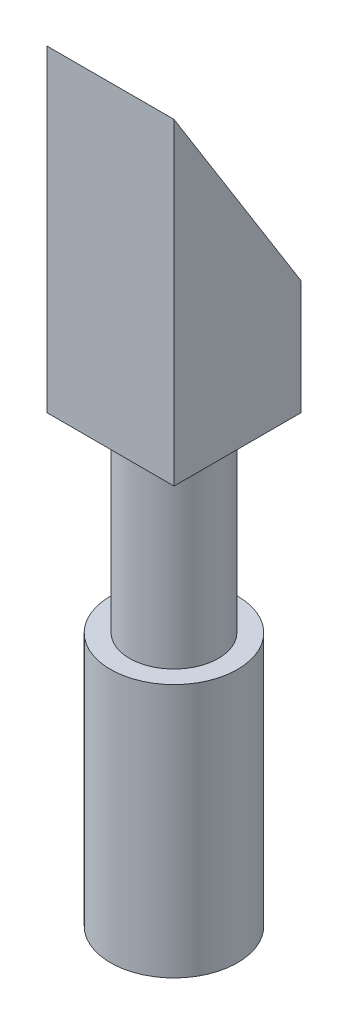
ISO-10303-21;
HEADER;
FILE_DESCRIPTION(('STEP AP214'),'2;1');
FILE_NAME('part.step','',(''),(''),'','','');
FILE_SCHEMA(('AUTOMOTIVE_DESIGN { 1 0 10303 214 1 1 1 1 }'));
ENDSEC;
DATA;
#1=APPLICATION_CONTEXT('core data for automotive mechanical design processes');
#2=APPLICATION_PROTOCOL_DEFINITION('international standard','automotive_design',2000,#1);
#3=PRODUCT_CONTEXT('',#1,'mechanical');
#4=PRODUCT('Part','Part','',(#3));
#5=PRODUCT_RELATED_PRODUCT_CATEGORY('part','',(#4));
#6=PRODUCT_DEFINITION_FORMATION('','',#4);
#7=PRODUCT_DEFINITION_CONTEXT('part definition',#1,'design');
#8=PRODUCT_DEFINITION('design','',#6,#7);
#9=PRODUCT_DEFINITION_SHAPE('','',#8);
#10=(LENGTH_UNIT() NAMED_UNIT(*) SI_UNIT(.MILLI.,.METRE.));
#11=(NAMED_UNIT(*) PLANE_ANGLE_UNIT() SI_UNIT($,.RADIAN.));
#12=(NAMED_UNIT(*) SI_UNIT($,.STERADIAN.) SOLID_ANGLE_UNIT());
#13=UNCERTAINTY_MEASURE_WITH_UNIT(LENGTH_MEASURE(1.E-05),#10,'distance_accuracy_value','');
#14=(GEOMETRIC_REPRESENTATION_CONTEXT(3) GLOBAL_UNCERTAINTY_ASSIGNED_CONTEXT((#13)) GLOBAL_UNIT_ASSIGNED_CONTEXT((#10,
#11,#12)) REPRESENTATION_CONTEXT('',''));
#15=CARTESIAN_POINT('',(0.,0.,0.));
#16=DIRECTION('',(0.,0.,1.));
#17=DIRECTION('',(1.,0.,0.));
#18=AXIS2_PLACEMENT_3D('',#15,#16,#17);
#19=CARTESIAN_POINT('',(7.19396066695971,0.,6.35466525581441));
#20=DIRECTION('',(0.,1.,0.));
#21=DIRECTION('',(0.,0.,1.));
#22=AXIS2_PLACEMENT_3D('',#19,#20,#21);
#23=PLANE('',#22);
#24=DIRECTION('',(0.,0.,-1.));
#25=VECTOR('',#24,1.);
#26=CARTESIAN_POINT('',(7.19396066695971,0.,-6.3453347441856));
#27=LINE('',#26,#25);
#28=CARTESIAN_POINT('',(7.19396066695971,0.,6.35466525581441));
#29=VERTEX_POINT('',#28);
#30=CARTESIAN_POINT('',(7.19396066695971,0.,-6.3453347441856));
#31=VERTEX_POINT('',#30);
#32=EDGE_CURVE('E88',#29,#31,#27,.T.);
#33=ORIENTED_EDGE('',*,*,#32,.F.);
#34=DIRECTION('',(1.,0.,0.));
#35=VECTOR('',#34,1.);
#36=CARTESIAN_POINT('',(-5.50603933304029,0.,6.35466525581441));
#37=LINE('',#36,#35);
#38=CARTESIAN_POINT('',(-5.50603933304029,0.,6.35466525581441));
#39=VERTEX_POINT('',#38);
#40=EDGE_CURVE('E79',#39,#29,#37,.T.);
#41=ORIENTED_EDGE('',*,*,#40,.F.);
#42=DIRECTION('',(0.,0.,1.));
#43=VECTOR('',#42,1.);
#44=CARTESIAN_POINT('',(-5.50603933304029,0.,-6.3453347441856));
#45=LINE('',#44,#43);
#46=CARTESIAN_POINT('',(-5.50603933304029,0.,-6.3453347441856));
#47=VERTEX_POINT('',#46);
#48=EDGE_CURVE('E92',#47,#39,#45,.T.);
#49=ORIENTED_EDGE('',*,*,#48,.F.);
#50=DIRECTION('',(-1.,0.,0.));
#51=VECTOR('',#50,1.);
#52=CARTESIAN_POINT('',(-5.50603933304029,0.,-6.3453347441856));
#53=LINE('',#52,#51);
#54=EDGE_CURVE('E97',#31,#47,#53,.T.);
#55=ORIENTED_EDGE('',*,*,#54,.F.);
#56=EDGE_LOOP('',(#33,#41,#49,#55));
#57=FACE_BOUND('',#56,.T.);
#58=CARTESIAN_POINT('',(0.843960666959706,0.,0.0046652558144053));
#59=DIRECTION('',(0.,1.,0.));
#60=DIRECTION('',(0.,0.,1.));
#61=AXIS2_PLACEMENT_3D('',#58,#59,#60);
#62=CIRCLE('',#61,4.445);
#63=CARTESIAN_POINT('',(0.843960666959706,0.,4.4496652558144));
#64=VERTEX_POINT('',#63);
#65=EDGE_CURVE('E11',#64,#64,#62,.F.);
#66=ORIENTED_EDGE('',*,*,#65,.F.);
#67=EDGE_LOOP('',(#66));
#68=FACE_BOUND('',#67,.T.);
#69=ADVANCED_FACE('F31',(#57,#68),#23,.F.);
#70=CARTESIAN_POINT('',(7.19396066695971,31.75,-6.3453347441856));
#71=DIRECTION('',(-1.,0.,0.));
#72=DIRECTION('',(0.,0.,1.));
#73=AXIS2_PLACEMENT_3D('',#70,#71,#72);
#74=PLANE('',#73);
#75=DIRECTION('',(0.,-0.847998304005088,-0.52999894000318));
#76=VECTOR('',#75,1.);
#77=CARTESIAN_POINT('',(7.19396066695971,26.0421348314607,2.78724952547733));
#78=LINE('',#77,#76);
#79=CARTESIAN_POINT('',(7.19396066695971,31.75,6.35466525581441));
#80=VERTEX_POINT('',#79);
#81=CARTESIAN_POINT('',(7.19396066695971,11.43,-6.3453347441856));
#82=VERTEX_POINT('',#81);
#83=EDGE_CURVE('E86',#80,#82,#78,.T.);
#84=ORIENTED_EDGE('',*,*,#83,.F.);
#85=DIRECTION('',(0.,-1.,0.));
#86=VECTOR('',#85,1.);
#87=CARTESIAN_POINT('',(7.19396066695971,31.75,6.35466525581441));
#88=LINE('',#87,#86);
#89=EDGE_CURVE('E72',#80,#29,#88,.T.);
#90=ORIENTED_EDGE('',*,*,#89,.T.);
#91=ORIENTED_EDGE('',*,*,#32,.T.);
#92=DIRECTION('',(0.,-1.,0.));
#93=VECTOR('',#92,1.);
#94=CARTESIAN_POINT('',(7.19396066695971,31.75,-6.3453347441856));
#95=LINE('',#94,#93);
#96=EDGE_CURVE('E39',#82,#31,#95,.T.);
#97=ORIENTED_EDGE('',*,*,#96,.F.);
#98=EDGE_LOOP('',(#84,#90,#91,#97));
#99=FACE_BOUND('',#98,.T.);
#100=ADVANCED_FACE('F33',(#99),#74,.F.);
#101=CARTESIAN_POINT('',(-5.50603933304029,31.75,-6.3453347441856));
#102=DIRECTION('',(0.,0.,1.));
#103=DIRECTION('',(1.,0.,0.));
#104=AXIS2_PLACEMENT_3D('',#101,#102,#103);
#105=PLANE('',#104);
#106=DIRECTION('',(-1.,0.,0.));
#107=VECTOR('',#106,1.);
#108=CARTESIAN_POINT('',(52.7914266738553,11.43,-6.34533474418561));
#109=LINE('',#108,#107);
#110=CARTESIAN_POINT('',(-5.50603933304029,11.43,-6.3453347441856));
#111=VERTEX_POINT('',#110);
#112=EDGE_CURVE('E46',#82,#111,#109,.T.);
#113=ORIENTED_EDGE('',*,*,#112,.F.);
#114=ORIENTED_EDGE('',*,*,#96,.T.);
#115=ORIENTED_EDGE('',*,*,#54,.T.);
#116=DIRECTION('',(0.,-1.,0.));
#117=VECTOR('',#116,1.);
#118=CARTESIAN_POINT('',(-5.50603933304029,31.75,-6.3453347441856));
#119=LINE('',#118,#117);
#120=EDGE_CURVE('E102',#111,#47,#119,.T.);
#121=ORIENTED_EDGE('',*,*,#120,.F.);
#122=EDGE_LOOP('',(#113,#114,#115,#121));
#123=FACE_BOUND('',#122,.T.);
#124=ADVANCED_FACE('F104',(#123),#105,.F.);
#125=CARTESIAN_POINT('',(-5.50603933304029,31.75,-6.3453347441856));
#126=DIRECTION('',(1.,0.,0.));
#127=DIRECTION('',(0.,0.,-1.));
#128=AXIS2_PLACEMENT_3D('',#125,#126,#127);
#129=PLANE('',#128);
#130=DIRECTION('',(0.,0.847998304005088,0.52999894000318));
#131=VECTOR('',#130,1.);
#132=CARTESIAN_POINT('',(-5.50603933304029,26.0421348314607,2.78724952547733));
#133=LINE('',#132,#131);
#134=CARTESIAN_POINT('',(-5.50603933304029,31.75,6.35466525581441));
#135=VERTEX_POINT('',#134);
#136=EDGE_CURVE('E54',#111,#135,#133,.T.);
#137=ORIENTED_EDGE('',*,*,#136,.F.);
#138=ORIENTED_EDGE('',*,*,#120,.T.);
#139=ORIENTED_EDGE('',*,*,#48,.T.);
#140=DIRECTION('',(0.,-1.,0.));
#141=VECTOR('',#140,1.);
#142=CARTESIAN_POINT('',(-5.50603933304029,31.75,6.35466525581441));
#143=LINE('',#142,#141);
#144=EDGE_CURVE('E83',#135,#39,#143,.T.);
#145=ORIENTED_EDGE('',*,*,#144,.F.);
#146=EDGE_LOOP('',(#137,#138,#139,#145));
#147=FACE_BOUND('',#146,.T.);
#148=ADVANCED_FACE('F108',(#147),#129,.F.);
#149=CARTESIAN_POINT('',(-5.50603933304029,31.75,6.35466525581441));
#150=DIRECTION('',(0.,0.,-1.));
#151=DIRECTION('',(-1.,0.,0.));
#152=AXIS2_PLACEMENT_3D('',#149,#150,#151);
#153=PLANE('',#152);
#154=ORIENTED_EDGE('',*,*,#40,.T.);
#155=ORIENTED_EDGE('',*,*,#89,.F.);
#156=DIRECTION('',(1.,0.,0.));
#157=VECTOR('',#156,1.);
#158=CARTESIAN_POINT('',(-5.50603933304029,31.75,6.35466525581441));
#159=LINE('',#158,#157);
#160=EDGE_CURVE('E77',#135,#80,#159,.T.);
#161=ORIENTED_EDGE('',*,*,#160,.F.);
#162=ORIENTED_EDGE('',*,*,#144,.T.);
#163=EDGE_LOOP('',(#154,#155,#161,#162));
#164=FACE_BOUND('',#163,.T.);
#165=ADVANCED_FACE('F74',(#164),#153,.F.);
#166=CARTESIAN_POINT('',(52.7914266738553,31.75,6.3546652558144));
#167=DIRECTION('',(0.,0.52999894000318,-0.847998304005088));
#168=DIRECTION('',(0.,0.847998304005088,0.52999894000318));
#169=AXIS2_PLACEMENT_3D('',#166,#167,#168);
#170=PLANE('',#169);
#171=ORIENTED_EDGE('',*,*,#160,.T.);
#172=ORIENTED_EDGE('',*,*,#83,.T.);
#173=ORIENTED_EDGE('',*,*,#112,.T.);
#174=ORIENTED_EDGE('',*,*,#136,.T.);
#175=EDGE_LOOP('',(#171,#172,#173,#174));
#176=FACE_BOUND('',#175,.T.);
#177=ADVANCED_FACE('F90',(#176),#170,.T.);
#178=CARTESIAN_POINT('',(0.843960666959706,-19.05,0.0046652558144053));
#179=DIRECTION('',(0.,1.,0.));
#180=DIRECTION('',(0.,0.,1.));
#181=AXIS2_PLACEMENT_3D('',#178,#179,#180);
#182=CYLINDRICAL_SURFACE('',#181,4.445);
#183=CARTESIAN_POINT('',(0.843960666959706,-19.05,0.0046652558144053));
#184=DIRECTION('',(0.,-1.,0.));
#185=DIRECTION('',(0.,0.,-1.));
#186=AXIS2_PLACEMENT_3D('',#183,#184,#185);
#187=CIRCLE('',#186,4.445);
#188=CARTESIAN_POINT('',(0.843960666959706,-19.05,4.4496652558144));
#189=VERTEX_POINT('',#188);
#190=EDGE_CURVE('E109',#189,#189,#187,.T.);
#191=CARTESIAN_POINT('',(0.843960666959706,-19.05,4.4496652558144));
#192=CARTESIAN_POINT('',(0.843960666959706,-18.8515625,4.4496652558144));
#193=CARTESIAN_POINT('',(0.843960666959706,-18.653125,4.4496652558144));
#194=CARTESIAN_POINT('',(0.843960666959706,-18.25625,4.4496652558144));
#195=CARTESIAN_POINT('',(0.843960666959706,-18.0578125,4.4496652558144));
#196=CARTESIAN_POINT('',(0.843960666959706,-17.6609375,4.4496652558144));
#197=CARTESIAN_POINT('',(0.843960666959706,-17.4625,4.4496652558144));
#198=CARTESIAN_POINT('',(0.843960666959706,-17.065625,4.4496652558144));
#199=CARTESIAN_POINT('',(0.843960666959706,-16.8671875,4.4496652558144));
#200=CARTESIAN_POINT('',(0.843960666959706,-16.4703125,4.4496652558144));
#201=CARTESIAN_POINT('',(0.843960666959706,-16.271875,4.4496652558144));
#202=CARTESIAN_POINT('',(0.843960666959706,-15.875,4.4496652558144));
#203=CARTESIAN_POINT('',(0.843960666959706,-15.6765625,4.4496652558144));
#204=CARTESIAN_POINT('',(0.843960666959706,-15.2796875,4.4496652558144));
#205=CARTESIAN_POINT('',(0.843960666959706,-15.08125,4.4496652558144));
#206=CARTESIAN_POINT('',(0.843960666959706,-14.684375,4.4496652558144));
#207=CARTESIAN_POINT('',(0.843960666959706,-14.4859375,4.4496652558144));
#208=CARTESIAN_POINT('',(0.843960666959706,-14.0890625,4.4496652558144));
#209=CARTESIAN_POINT('',(0.843960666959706,-13.890625,4.4496652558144));
#210=CARTESIAN_POINT('',(0.843960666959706,-13.49375,4.4496652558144));
#211=CARTESIAN_POINT('',(0.843960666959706,-13.2953125,4.4496652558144));
#212=CARTESIAN_POINT('',(0.843960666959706,-12.8984375,4.4496652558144));
#213=CARTESIAN_POINT('',(0.843960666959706,-12.7,4.4496652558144));
#214=CARTESIAN_POINT('',(0.843960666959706,-12.303125,4.4496652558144));
#215=CARTESIAN_POINT('',(0.843960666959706,-12.1046875,4.4496652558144));
#216=CARTESIAN_POINT('',(0.843960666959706,-11.7078125,4.4496652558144));
#217=CARTESIAN_POINT('',(0.843960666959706,-11.509375,4.4496652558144));
#218=CARTESIAN_POINT('',(0.843960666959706,-11.1125,4.4496652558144));
#219=CARTESIAN_POINT('',(0.843960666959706,-10.9140625,4.4496652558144));
#220=CARTESIAN_POINT('',(0.843960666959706,-10.5171875,4.4496652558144));
#221=CARTESIAN_POINT('',(0.843960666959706,-10.31875,4.4496652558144));
#222=CARTESIAN_POINT('',(0.843960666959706,-9.921875,4.4496652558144));
#223=CARTESIAN_POINT('',(0.843960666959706,-9.7234375,4.4496652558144));
#224=CARTESIAN_POINT('',(0.843960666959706,-9.3265625,4.4496652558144));
#225=CARTESIAN_POINT('',(0.843960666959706,-9.128125,4.4496652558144));
#226=CARTESIAN_POINT('',(0.843960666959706,-8.73125,4.4496652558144));
#227=CARTESIAN_POINT('',(0.843960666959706,-8.5328125,4.4496652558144));
#228=CARTESIAN_POINT('',(0.843960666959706,-8.1359375,4.4496652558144));
#229=CARTESIAN_POINT('',(0.843960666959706,-7.9375,4.4496652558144));
#230=CARTESIAN_POINT('',(0.843960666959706,-7.540625,4.4496652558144));
#231=CARTESIAN_POINT('',(0.843960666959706,-7.3421875,4.4496652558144));
#232=CARTESIAN_POINT('',(0.843960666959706,-6.9453125,4.4496652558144));
#233=CARTESIAN_POINT('',(0.843960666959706,-6.746875,4.4496652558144));
#234=CARTESIAN_POINT('',(0.843960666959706,-6.35,4.4496652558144));
#235=CARTESIAN_POINT('',(0.843960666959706,-6.1515625,4.4496652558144));
#236=CARTESIAN_POINT('',(0.843960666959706,-5.7546875,4.4496652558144));
#237=CARTESIAN_POINT('',(0.843960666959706,-5.55625,4.4496652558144));
#238=CARTESIAN_POINT('',(0.843960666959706,-5.159375,4.4496652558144));
#239=CARTESIAN_POINT('',(0.843960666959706,-4.9609375,4.4496652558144));
#240=CARTESIAN_POINT('',(0.843960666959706,-4.5640625,4.4496652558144));
#241=CARTESIAN_POINT('',(0.843960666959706,-4.365625,4.4496652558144));
#242=CARTESIAN_POINT('',(0.843960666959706,-3.96875,4.4496652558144));
#243=CARTESIAN_POINT('',(0.843960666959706,-3.7703125,4.4496652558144));
#244=CARTESIAN_POINT('',(0.843960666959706,-3.3734375,4.4496652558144));
#245=CARTESIAN_POINT('',(0.843960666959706,-3.175,4.4496652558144));
#246=CARTESIAN_POINT('',(0.843960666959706,-2.778125,4.4496652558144));
#247=CARTESIAN_POINT('',(0.843960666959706,-2.5796875,4.4496652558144));
#248=CARTESIAN_POINT('',(0.843960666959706,-2.1828125,4.4496652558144));
#249=CARTESIAN_POINT('',(0.843960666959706,-1.984375,4.4496652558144));
#250=CARTESIAN_POINT('',(0.843960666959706,-1.5875,4.4496652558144));
#251=CARTESIAN_POINT('',(0.843960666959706,-1.3890625,4.4496652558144));
#252=CARTESIAN_POINT('',(0.843960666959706,-0.992187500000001,4.4496652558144));
#253=CARTESIAN_POINT('',(0.843960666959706,-0.793750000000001,4.4496652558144));
#254=CARTESIAN_POINT('',(0.843960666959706,-0.396875,4.4496652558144));
#255=CARTESIAN_POINT('',(0.843960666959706,-0.1984375,4.4496652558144));
#256=CARTESIAN_POINT('',(0.843960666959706,0.,4.4496652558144));
#257=B_SPLINE_CURVE_WITH_KNOTS('',3,(#191,#192,#193,#194,#195,#196,#197,#198,#199,#200,#201,
#202,#203,#204,#205,#206,#207,#208,#209,#210,#211,#212,#213,#214,#215,#216,#217,#218,#219,#220,
#221,#222,#223,#224,#225,#226,#227,#228,#229,#230,#231,#232,#233,#234,#235,#236,#237,#238,#239,
#240,#241,#242,#243,#244,#245,#246,#247,#248,#249,#250,#251,#252,#253,#254,#255,#256),
.UNSPECIFIED.,.F.,.F.,(4,2,2,2,2,2,2,2,2,2,2,2,2,2,2,2,2,2,2,2,2,2,2,2,2,2,2,2,2,2,2,2,4),(0.,
0.595312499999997,1.190625,1.7859375,2.38125,2.9765625,3.571875,4.1671875,4.7625,5.3578125,
5.953125,6.5484375,7.14375,7.7390625,8.334375,8.9296875,9.525,10.1203125,10.715625,11.3109375,
11.90625,12.5015625,13.096875,13.6921875,14.2875,14.8828125,15.478125,16.0734375,16.66875,
17.2640625,17.859375,18.4546875,19.05),.UNSPECIFIED.);
#258=EDGE_CURVE('BSEAM132',#189,#64,#257,.T.);
#259=ORIENTED_EDGE('',*,*,#190,.F.);
#260=ORIENTED_EDGE('',*,*,#65,.T.);
#261=ORIENTED_EDGE('',*,*,#258,.T.);
#262=ORIENTED_EDGE('',*,*,#258,.F.);
#263=EDGE_LOOP('',(#259,#261,#260,#262));
#264=FACE_BOUND('',#263,.T.);
#265=ADVANCED_FACE('F132',(#264),#182,.T.);
#266=CARTESIAN_POINT('',(0.843960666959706,-19.05,0.0046652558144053));
#267=DIRECTION('',(0.,-1.,0.));
#268=DIRECTION('',(0.,0.,-1.));
#269=AXIS2_PLACEMENT_3D('',#266,#267,#268);
#270=PLANE('',#269);
#271=CARTESIAN_POINT('',(0.843960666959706,-19.05,0.0046652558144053));
#272=DIRECTION('',(0.,-1.,0.));
#273=DIRECTION('',(0.,0.,-1.));
#274=AXIS2_PLACEMENT_3D('',#271,#272,#273);
#275=CIRCLE('',#274,6.35);
#276=CARTESIAN_POINT('',(0.843960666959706,-19.05,-6.34533474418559));
#277=VERTEX_POINT('',#276);
#278=EDGE_CURVE('E115',#277,#277,#275,.T.);
#279=ORIENTED_EDGE('',*,*,#278,.F.);
#280=EDGE_LOOP('',(#279));
#281=FACE_BOUND('',#280,.T.);
#282=ORIENTED_EDGE('',*,*,#190,.T.);
#283=EDGE_LOOP('',(#282));
#284=FACE_BOUND('',#283,.T.);
#285=ADVANCED_FACE('F126',(#281,#284),#270,.F.);
#286=CARTESIAN_POINT('',(0.843960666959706,-44.45,0.0046652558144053));
#287=DIRECTION('',(0.,1.,0.));
#288=DIRECTION('',(0.,0.,1.));
#289=AXIS2_PLACEMENT_3D('',#286,#287,#288);
#290=CYLINDRICAL_SURFACE('',#289,6.35);
#291=CARTESIAN_POINT('',(0.843960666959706,-44.45,0.0046652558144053));
#292=DIRECTION('',(0.,-1.,0.));
#293=DIRECTION('',(0.,0.,-1.));
#294=AXIS2_PLACEMENT_3D('',#291,#292,#293);
#295=CIRCLE('',#294,6.35);
#296=CARTESIAN_POINT('',(0.843960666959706,-44.45,-6.34533474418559));
#297=VERTEX_POINT('',#296);
#298=EDGE_CURVE('E112',#297,#297,#295,.T.);
#299=ORIENTED_EDGE('',*,*,#298,.F.);
#300=EDGE_LOOP('',(#299));
#301=FACE_BOUND('',#300,.T.);
#302=ORIENTED_EDGE('',*,*,#278,.T.);
#303=EDGE_LOOP('',(#302));
#304=FACE_BOUND('',#303,.T.);
#305=ADVANCED_FACE('F123',(#301,#304),#290,.T.);
#306=CARTESIAN_POINT('',(0.843960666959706,-44.45,0.0046652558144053));
#307=DIRECTION('',(0.,-1.,0.));
#308=DIRECTION('',(0.,0.,-1.));
#309=AXIS2_PLACEMENT_3D('',#306,#307,#308);
#310=PLANE('',#309);
#311=ORIENTED_EDGE('',*,*,#298,.T.);
#312=EDGE_LOOP('',(#311));
#313=FACE_BOUND('',#312,.T.);
#314=ADVANCED_FACE('F121',(#313),#310,.T.);
#315=CLOSED_SHELL('',(#69,#100,#124,#148,#165,#177,#265,#285,#305,#314));
#316=MANIFOLD_SOLID_BREP('B2',#315);
#317=ADVANCED_BREP_SHAPE_REPRESENTATION('',(#18,#316),#14);
#318=SHAPE_DEFINITION_REPRESENTATION(#9,#317);
ENDSEC;
END-ISO-10303-21;
